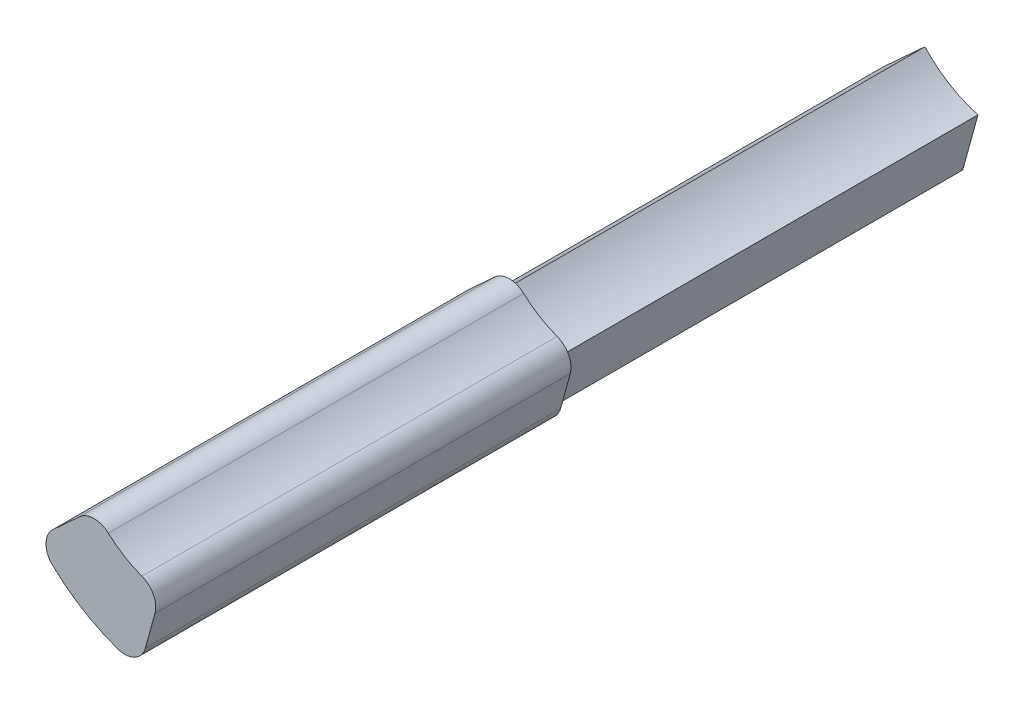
ISO-10303-21;
HEADER;
FILE_DESCRIPTION(('STEP AP214'),'2;1');
FILE_NAME('part.step','',(''),(''),'','','');
FILE_SCHEMA(('AUTOMOTIVE_DESIGN { 1 0 10303 214 1 1 1 1 }'));
ENDSEC;
DATA;
#1=APPLICATION_CONTEXT('core data for automotive mechanical design processes');
#2=APPLICATION_PROTOCOL_DEFINITION('international standard','automotive_design',2000,#1);
#3=PRODUCT_CONTEXT('',#1,'mechanical');
#4=PRODUCT('Part','Part','',(#3));
#5=PRODUCT_RELATED_PRODUCT_CATEGORY('part','',(#4));
#6=PRODUCT_DEFINITION_FORMATION('','',#4);
#7=PRODUCT_DEFINITION_CONTEXT('part definition',#1,'design');
#8=PRODUCT_DEFINITION('design','',#6,#7);
#9=PRODUCT_DEFINITION_SHAPE('','',#8);
#10=(LENGTH_UNIT() NAMED_UNIT(*) SI_UNIT(.MILLI.,.METRE.));
#11=(NAMED_UNIT(*) PLANE_ANGLE_UNIT() SI_UNIT($,.RADIAN.));
#12=(NAMED_UNIT(*) SI_UNIT($,.STERADIAN.) SOLID_ANGLE_UNIT());
#13=UNCERTAINTY_MEASURE_WITH_UNIT(LENGTH_MEASURE(1.E-05),#10,'distance_accuracy_value','');
#14=(GEOMETRIC_REPRESENTATION_CONTEXT(3) GLOBAL_UNCERTAINTY_ASSIGNED_CONTEXT((#13)) GLOBAL_UNIT_ASSIGNED_CONTEXT((#10,
#11,#12)) REPRESENTATION_CONTEXT('',''));
#15=CARTESIAN_POINT('',(0.,0.,0.));
#16=DIRECTION('',(0.,0.,1.));
#17=DIRECTION('',(1.,0.,0.));
#18=AXIS2_PLACEMENT_3D('',#15,#16,#17);
#19=CARTESIAN_POINT('',(-4.413136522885E-12,-4.13558076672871E-12,39.));
#20=DIRECTION('',(0.,0.,-1.));
#21=DIRECTION('',(-1.00000000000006,0.,0.));
#22=AXIS2_PLACEMENT_3D('',#19,#20,#21);
#23=CYLINDRICAL_SURFACE('',#22,8.);
#24=CARTESIAN_POINT('',(-3.740063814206E-12,-4.63518112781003E-12,19.4999999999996));
#25=DIRECTION('',(0.,0.,1.));
#26=DIRECTION('',(1.00000000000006,0.,0.));
#27=AXIS2_PLACEMENT_3D('',#24,#25,#26);
#28=CIRCLE('',#27,8.);
#29=CARTESIAN_POINT('',(-5.88910037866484,-5.41465573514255,19.4999999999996));
#30=VERTEX_POINT('',#29);
#31=CARTESIAN_POINT('',(-2.12490998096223,-7.71263622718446,19.5));
#32=VERTEX_POINT('',#31);
#33=EDGE_CURVE('E137',#30,#32,#28,.T.);
#34=ORIENTED_EDGE('',*,*,#33,.F.);
#35=DIRECTION('',(0.,0.,-1.));
#36=VECTOR('',#35,1.);
#37=CARTESIAN_POINT('',(-5.8891003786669,-5.41465573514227,39.));
#38=LINE('',#37,#36);
#39=CARTESIAN_POINT('',(-5.88910037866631,-5.41465573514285,-6.00214322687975E-13));
#40=VERTEX_POINT('',#39);
#41=EDGE_CURVE('E122',#30,#40,#38,.T.);
#42=ORIENTED_EDGE('',*,*,#41,.T.);
#43=CARTESIAN_POINT('',(0.,0.,0.));
#44=DIRECTION('',(0.,0.,1.));
#45=DIRECTION('',(1.00000000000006,0.,0.));
#46=AXIS2_PLACEMENT_3D('',#43,#44,#45);
#47=CIRCLE('',#46,8.);
#48=CARTESIAN_POINT('',(-2.12490998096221,-7.71263622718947,-9.64506252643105E-13));
#49=VERTEX_POINT('',#48);
#50=EDGE_CURVE('E141',#40,#49,#47,.T.);
#51=ORIENTED_EDGE('',*,*,#50,.T.);
#52=DIRECTION('',(0.,0.,-1.));
#53=VECTOR('',#52,1.);
#54=CARTESIAN_POINT('',(-2.1249099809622,-7.71263622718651,39.));
#55=LINE('',#54,#53);
#56=EDGE_CURVE('E138',#32,#49,#55,.T.);
#57=ORIENTED_EDGE('',*,*,#56,.F.);
#58=EDGE_LOOP('',(#34,#42,#51,#57));
#59=FACE_BOUND('',#58,.T.);
#60=ADVANCED_FACE('F35',(#59),#23,.T.);
#61=CARTESIAN_POINT('',(-1.40775286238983,-5.10962150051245,39.0000000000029));
#62=DIRECTION('',(-0.964079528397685,0.265613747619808,0.));
#63=DIRECTION('',(-0.26561374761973,-0.964079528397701,0.));
#64=AXIS2_PLACEMENT_3D('',#61,#62,#63);
#65=PLANE('',#64);
#66=DIRECTION('',(0.26561374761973,0.964079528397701,0.));
#67=VECTOR('',#66,1.);
#68=CARTESIAN_POINT('',(-1.40775286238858,-5.10962150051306,19.4999999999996));
#69=LINE('',#68,#67);
#70=CARTESIAN_POINT('',(-1.40775286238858,-5.10962150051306,19.4999999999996));
#71=VERTEX_POINT('',#70);
#72=EDGE_CURVE('E142',#32,#71,#69,.T.);
#73=ORIENTED_EDGE('',*,*,#72,.F.);
#74=ORIENTED_EDGE('',*,*,#56,.T.);
#75=DIRECTION('',(0.26561374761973,0.964079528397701,0.));
#76=VECTOR('',#75,1.);
#77=CARTESIAN_POINT('',(-1.40775286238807,-5.10962150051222,-5.96744875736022E-13));
#78=LINE('',#77,#76);
#79=CARTESIAN_POINT('',(-1.40775286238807,-5.10962150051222,-5.96744875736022E-13));
#80=VERTEX_POINT('',#79);
#81=EDGE_CURVE('E213',#49,#80,#78,.T.);
#82=ORIENTED_EDGE('',*,*,#81,.T.);
#83=DIRECTION('',(0.,0.,-1.));
#84=VECTOR('',#83,1.);
#85=CARTESIAN_POINT('',(-1.40775286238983,-5.10962150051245,39.0000000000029));
#86=LINE('',#85,#84);
#87=EDGE_CURVE('E151',#71,#80,#86,.T.);
#88=ORIENTED_EDGE('',*,*,#87,.F.);
#89=EDGE_LOOP('',(#73,#74,#82,#88));
#90=FACE_BOUND('',#89,.T.);
#91=ADVANCED_FACE('F226',(#90),#65,.F.);
#92=CARTESIAN_POINT('',(-4.413136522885E-12,-4.13558076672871E-12,39.));
#93=DIRECTION('',(0.,0.,-1.));
#94=DIRECTION('',(-1.00000000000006,0.,0.));
#95=AXIS2_PLACEMENT_3D('',#92,#93,#94);
#96=CYLINDRICAL_SURFACE('',#95,5.3);
#97=CARTESIAN_POINT('',(-3.740063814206E-12,-4.63518112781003E-12,19.4999999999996));
#98=DIRECTION('',(0.,0.,1.));
#99=DIRECTION('',(1.00000000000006,0.,0.));
#100=AXIS2_PLACEMENT_3D('',#97,#98,#99);
#101=CIRCLE('',#100,5.3);
#102=CARTESIAN_POINT('',(-3.90152900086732,-3.58720942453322,19.4999999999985));
#103=VERTEX_POINT('',#102);
#104=EDGE_CURVE('E146',#71,#103,#101,.F.);
#105=ORIENTED_EDGE('',*,*,#104,.F.);
#106=ORIENTED_EDGE('',*,*,#87,.T.);
#107=CARTESIAN_POINT('',(0.,0.,0.));
#108=DIRECTION('',(0.,0.,-1.));
#109=DIRECTION('',(1.00000000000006,0.,0.));
#110=AXIS2_PLACEMENT_3D('',#107,#108,#109);
#111=CIRCLE('',#110,5.3);
#112=CARTESIAN_POINT('',(-3.90152900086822,-3.58720942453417,-9.61036805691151E-13));
#113=VERTEX_POINT('',#112);
#114=EDGE_CURVE('E216',#80,#113,#111,.T.);
#115=ORIENTED_EDGE('',*,*,#114,.T.);
#116=DIRECTION('',(0.,0.,-1.));
#117=VECTOR('',#116,1.);
#118=CARTESIAN_POINT('',(-3.90152900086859,-3.58720942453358,39.));
#119=LINE('',#118,#117);
#120=EDGE_CURVE('E133',#103,#113,#119,.T.);
#121=ORIENTED_EDGE('',*,*,#120,.F.);
#122=EDGE_LOOP('',(#105,#106,#115,#121));
#123=FACE_BOUND('',#122,.T.);
#124=ADVANCED_FACE('F222',(#123),#96,.F.);
#125=CARTESIAN_POINT('',(-3.90152900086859,-3.58720942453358,39.));
#126=DIRECTION('',(0.676831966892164,-0.736137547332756,0.));
#127=DIRECTION('',(0.736137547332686,0.676831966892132,0.));
#128=AXIS2_PLACEMENT_3D('',#125,#126,#127);
#129=PLANE('',#128);
#130=DIRECTION('',(-0.736137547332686,-0.676831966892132,0.));
#131=VECTOR('',#130,1.);
#132=CARTESIAN_POINT('',(-3.90152900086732,-3.58720942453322,19.4999999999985));
#133=LINE('',#132,#131);
#134=EDGE_CURVE('E126',#103,#30,#133,.T.);
#135=ORIENTED_EDGE('',*,*,#134,.F.);
#136=ORIENTED_EDGE('',*,*,#120,.T.);
#137=DIRECTION('',(-0.736137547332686,-0.676831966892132,0.));
#138=VECTOR('',#137,1.);
#139=CARTESIAN_POINT('',(-3.90152900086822,-3.58720942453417,-9.61036805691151E-13));
#140=LINE('',#139,#138);
#141=EDGE_CURVE('E129',#113,#40,#140,.T.);
#142=ORIENTED_EDGE('',*,*,#141,.T.);
#143=ORIENTED_EDGE('',*,*,#41,.F.);
#144=EDGE_LOOP('',(#135,#136,#142,#143));
#145=FACE_BOUND('',#144,.T.);
#146=ADVANCED_FACE('F124',(#145),#129,.F.);
#147=CARTESIAN_POINT('',(0.,0.,0.));
#148=DIRECTION('',(0.,0.,1.));
#149=DIRECTION('',(1.00000000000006,0.,0.));
#150=AXIS2_PLACEMENT_3D('',#147,#148,#149);
#151=PLANE('',#150);
#152=ORIENTED_EDGE('',*,*,#50,.F.);
#153=ORIENTED_EDGE('',*,*,#141,.F.);
#154=ORIENTED_EDGE('',*,*,#114,.F.);
#155=ORIENTED_EDGE('',*,*,#81,.F.);
#156=EDGE_LOOP('',(#152,#153,#154,#155));
#157=FACE_BOUND('',#156,.T.);
#158=ADVANCED_FACE('F228',(#157),#151,.F.);
#159=CARTESIAN_POINT('',(-3.740063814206E-12,-4.63518112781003E-12,19.4999999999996));
#160=DIRECTION('',(0.,0.,1.));
#161=DIRECTION('',(1.00000000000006,0.,0.));
#162=AXIS2_PLACEMENT_3D('',#159,#160,#161);
#163=PLANE('',#162);
#164=CARTESIAN_POINT('',(-3.740063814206E-12,-4.63518112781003E-12,19.4999999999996));
#165=DIRECTION('',(0.,0.,1.));
#166=DIRECTION('',(1.00000000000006,0.,0.));
#167=AXIS2_PLACEMENT_3D('',#164,#165,#166);
#168=CIRCLE('',#167,8.5);
#169=CARTESIAN_POINT('',(-5.85971073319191,-6.15741748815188,19.5));
#170=VERTEX_POINT('',#169);
#171=CARTESIAN_POINT('',(-2.79900585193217,-8.02593086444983,19.5000000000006));
#172=VERTEX_POINT('',#171);
#173=EDGE_CURVE('E206',#170,#172,#168,.T.);
#174=ORIENTED_EDGE('',*,*,#173,.F.);
#175=CARTESIAN_POINT('',(-5.17033299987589,-5.43301543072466,19.4999999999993));
#176=DIRECTION('',(0.,0.,1.));
#177=DIRECTION('',(1.00000000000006,0.,0.));
#178=AXIS2_PLACEMENT_3D('',#175,#176,#177);
#179=CIRCLE('',#178,1.);
#180=CARTESIAN_POINT('',(-5.84716496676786,-4.69687788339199,19.4999999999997));
#181=VERTEX_POINT('',#180);
#182=EDGE_CURVE('E175',#170,#181,#179,.F.);
#183=ORIENTED_EDGE('',*,*,#182,.T.);
#184=DIRECTION('',(-0.736137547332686,-0.676831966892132,0.));
#185=VECTOR('',#184,1.);
#186=CARTESIAN_POINT('',(-3.85265367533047,-2.86305076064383,19.4999999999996));
#187=LINE('',#186,#185);
#188=CARTESIAN_POINT('',(-4.59211913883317,-3.54294253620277,19.5000000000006));
#189=VERTEX_POINT('',#188);
#190=EDGE_CURVE('E198',#189,#181,#187,.T.);
#191=ORIENTED_EDGE('',*,*,#190,.F.);
#192=CARTESIAN_POINT('',(-3.91528717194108,-4.27908008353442,19.4999999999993));
#193=DIRECTION('',(0.,0.,1.));
#194=DIRECTION('',(1.00000000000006,0.,0.));
#195=AXIS2_PLACEMENT_3D('',#192,#193,#194);
#196=CIRCLE('',#195,1.);
#197=CARTESIAN_POINT('',(-3.24023765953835,-3.54130765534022,19.4999999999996));
#198=VERTEX_POINT('',#197);
#199=EDGE_CURVE('E173',#189,#198,#196,.F.);
#200=ORIENTED_EDGE('',*,*,#199,.T.);
#201=CARTESIAN_POINT('',(-3.740063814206E-12,-4.63518112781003E-12,19.4999999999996));
#202=DIRECTION('',(0.,0.,-1.));
#203=DIRECTION('',(1.00000000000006,0.,0.));
#204=AXIS2_PLACEMENT_3D('',#201,#202,#203);
#205=CIRCLE('',#204,4.8);
#206=CARTESIAN_POINT('',(-1.66912915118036,-4.50044529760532,19.4999999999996));
#207=VERTEX_POINT('',#206);
#208=EDGE_CURVE('E194',#207,#198,#205,.T.);
#209=ORIENTED_EDGE('',*,*,#208,.F.);
#210=CARTESIAN_POINT('',(-2.01686439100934,-5.4380380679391,19.5000000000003));
#211=DIRECTION('',(0.,0.,1.));
#212=DIRECTION('',(1.00000000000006,0.,0.));
#213=AXIS2_PLACEMENT_3D('',#210,#211,#212);
#214=CIRCLE('',#213,1.);
#215=CARTESIAN_POINT('',(-1.05278486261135,-5.70365181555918,19.4999999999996));
#216=VERTEX_POINT('',#215);
#217=EDGE_CURVE('E49',#207,#216,#214,.F.);
#218=ORIENTED_EDGE('',*,*,#217,.T.);
#219=DIRECTION('',(0.26561374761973,0.964079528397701,0.));
#220=VECTOR('',#219,1.);
#221=CARTESIAN_POINT('',(-1.77176762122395,-8.31329293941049,19.4999999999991));
#222=LINE('',#221,#220);
#223=CARTESIAN_POINT('',(-1.50563151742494,-7.34731745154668,19.5000000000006));
#224=VERTEX_POINT('',#223);
#225=EDGE_CURVE('E186',#224,#216,#222,.T.);
#226=ORIENTED_EDGE('',*,*,#225,.F.);
#227=CARTESIAN_POINT('',(-2.46971104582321,-7.08170370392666,19.5));
#228=DIRECTION('',(0.,0.,1.));
#229=DIRECTION('',(1.00000000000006,0.,0.));
#230=AXIS2_PLACEMENT_3D('',#227,#228,#229);
#231=CIRCLE('',#230,1.);
#232=EDGE_CURVE('E171',#224,#172,#231,.F.);
#233=ORIENTED_EDGE('',*,*,#232,.T.);
#234=EDGE_LOOP('',(#174,#183,#191,#200,#209,#218,#226,#233));
#235=FACE_BOUND('',#234,.T.);
#236=ORIENTED_EDGE('',*,*,#134,.T.);
#237=ORIENTED_EDGE('',*,*,#33,.T.);
#238=ORIENTED_EDGE('',*,*,#72,.T.);
#239=ORIENTED_EDGE('',*,*,#104,.T.);
#240=EDGE_LOOP('',(#236,#237,#238,#239));
#241=FACE_BOUND('',#240,.T.);
#242=ADVANCED_FACE('F145',(#235,#241),#163,.F.);
#243=CARTESIAN_POINT('',(-3.740063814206E-12,-4.63518112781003E-12,19.4999999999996));
#244=DIRECTION('',(0.,0.,1.));
#245=DIRECTION('',(1.00000000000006,0.,0.));
#246=AXIS2_PLACEMENT_3D('',#243,#244,#245);
#247=CYLINDRICAL_SURFACE('',#246,4.8);
#248=ORIENTED_EDGE('',*,*,#208,.T.);
#249=DIRECTION('',(0.,0.,1.));
#250=VECTOR('',#249,1.);
#251=CARTESIAN_POINT('',(-3.24023765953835,-3.54130765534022,19.4999999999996));
#252=LINE('',#251,#250);
#253=CARTESIAN_POINT('',(-3.24023765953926,-3.54130765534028,39.));
#254=VERTEX_POINT('',#253);
#255=EDGE_CURVE('E179',#198,#254,#252,.T.);
#256=ORIENTED_EDGE('',*,*,#255,.T.);
#257=CARTESIAN_POINT('',(-4.413136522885E-12,-4.13558076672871E-12,39.));
#258=DIRECTION('',(0.,0.,-1.));
#259=DIRECTION('',(1.00000000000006,0.,0.));
#260=AXIS2_PLACEMENT_3D('',#257,#258,#259);
#261=CIRCLE('',#260,4.8);
#262=CARTESIAN_POINT('',(-1.66912915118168,-4.50044529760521,39.0000000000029));
#263=VERTEX_POINT('',#262);
#264=EDGE_CURVE('E278',#263,#254,#261,.T.);
#265=ORIENTED_EDGE('',*,*,#264,.F.);
#266=DIRECTION('',(0.,0.,1.));
#267=VECTOR('',#266,1.);
#268=CARTESIAN_POINT('',(-1.66912915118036,-4.50044529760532,19.4999999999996));
#269=LINE('',#268,#267);
#270=EDGE_CURVE('E177',#263,#207,#269,.F.);
#271=ORIENTED_EDGE('',*,*,#270,.T.);
#272=EDGE_LOOP('',(#248,#256,#265,#271));
#273=FACE_BOUND('',#272,.T.);
#274=ADVANCED_FACE('F235',(#273),#247,.F.);
#275=CARTESIAN_POINT('',(-1.77176762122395,-8.31329293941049,19.4999999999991));
#276=DIRECTION('',(0.964079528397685,-0.265613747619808,0.));
#277=DIRECTION('',(0.26561374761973,0.964079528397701,0.));
#278=AXIS2_PLACEMENT_3D('',#275,#276,#277);
#279=PLANE('',#278);
#280=DIRECTION('',(0.26561374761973,0.964079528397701,0.));
#281=VECTOR('',#280,1.);
#282=CARTESIAN_POINT('',(-1.77176762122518,-8.31329293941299,39.));
#283=LINE('',#282,#281);
#284=CARTESIAN_POINT('',(-1.50563151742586,-7.34731745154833,39.));
#285=VERTEX_POINT('',#284);
#286=CARTESIAN_POINT('',(-1.0527848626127,-5.70365181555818,39.0000000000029));
#287=VERTEX_POINT('',#286);
#288=EDGE_CURVE('E185',#285,#287,#283,.T.);
#289=ORIENTED_EDGE('',*,*,#288,.F.);
#290=DIRECTION('',(0.,0.,1.));
#291=VECTOR('',#290,1.);
#292=CARTESIAN_POINT('',(-1.50563151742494,-7.34731745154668,19.5000000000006));
#293=LINE('',#292,#291);
#294=EDGE_CURVE('E11',#285,#224,#293,.F.);
#295=ORIENTED_EDGE('',*,*,#294,.T.);
#296=ORIENTED_EDGE('',*,*,#225,.T.);
#297=DIRECTION('',(0.,0.,1.));
#298=VECTOR('',#297,1.);
#299=CARTESIAN_POINT('',(-1.05278486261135,-5.70365181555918,19.4999999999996));
#300=LINE('',#299,#298);
#301=EDGE_CURVE('E42',#216,#287,#300,.T.);
#302=ORIENTED_EDGE('',*,*,#301,.T.);
#303=EDGE_LOOP('',(#289,#295,#296,#302));
#304=FACE_BOUND('',#303,.T.);
#305=ADVANCED_FACE('F184',(#304),#279,.T.);
#306=CARTESIAN_POINT('',(-3.740063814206E-12,-4.63518112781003E-12,19.4999999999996));
#307=DIRECTION('',(0.,0.,1.));
#308=DIRECTION('',(1.00000000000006,0.,0.));
#309=AXIS2_PLACEMENT_3D('',#306,#307,#308);
#310=CYLINDRICAL_SURFACE('',#309,8.5);
#311=CARTESIAN_POINT('',(-4.413136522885E-12,-4.13558076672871E-12,39.));
#312=DIRECTION('',(0.,0.,1.));
#313=DIRECTION('',(1.00000000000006,0.,0.));
#314=AXIS2_PLACEMENT_3D('',#311,#312,#313);
#315=CIRCLE('',#314,8.5);
#316=CARTESIAN_POINT('',(-5.85971073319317,-6.15741748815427,39.));
#317=VERTEX_POINT('',#316);
#318=CARTESIAN_POINT('',(-2.79900585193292,-8.02593086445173,38.9999999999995));
#319=VERTEX_POINT('',#318);
#320=EDGE_CURVE('E195',#317,#319,#315,.T.);
#321=ORIENTED_EDGE('',*,*,#320,.F.);
#322=DIRECTION('',(0.,0.,1.));
#323=VECTOR('',#322,1.);
#324=CARTESIAN_POINT('',(-5.85971073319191,-6.15741748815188,19.5));
#325=LINE('',#324,#323);
#326=EDGE_CURVE('E168',#317,#170,#325,.F.);
#327=ORIENTED_EDGE('',*,*,#326,.T.);
#328=ORIENTED_EDGE('',*,*,#173,.T.);
#329=DIRECTION('',(0.,0.,1.));
#330=VECTOR('',#329,1.);
#331=CARTESIAN_POINT('',(-2.79900585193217,-8.02593086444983,19.5000000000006));
#332=LINE('',#331,#330);
#333=EDGE_CURVE('E165',#172,#319,#332,.T.);
#334=ORIENTED_EDGE('',*,*,#333,.T.);
#335=EDGE_LOOP('',(#321,#327,#328,#334));
#336=FACE_BOUND('',#335,.T.);
#337=ADVANCED_FACE('F258',(#336),#310,.T.);
#338=CARTESIAN_POINT('',(-3.85265367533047,-2.86305076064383,19.4999999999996));
#339=DIRECTION('',(-0.676831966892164,0.736137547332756,0.));
#340=DIRECTION('',(-0.736137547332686,-0.676831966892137,0.));
#341=AXIS2_PLACEMENT_3D('',#338,#339,#340);
#342=PLANE('',#341);
#343=ORIENTED_EDGE('',*,*,#190,.T.);
#344=DIRECTION('',(0.,0.,1.));
#345=VECTOR('',#344,1.);
#346=CARTESIAN_POINT('',(-5.84716496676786,-4.69687788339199,19.4999999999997));
#347=LINE('',#346,#345);
#348=CARTESIAN_POINT('',(-5.84716496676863,-4.69687788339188,39.));
#349=VERTEX_POINT('',#348);
#350=EDGE_CURVE('E149',#181,#349,#347,.T.);
#351=ORIENTED_EDGE('',*,*,#350,.T.);
#352=DIRECTION('',(-0.736137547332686,-0.676831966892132,0.));
#353=VECTOR('',#352,1.);
#354=CARTESIAN_POINT('',(-3.85265367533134,-2.86305076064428,39.));
#355=LINE('',#354,#353);
#356=CARTESIAN_POINT('',(-4.59211913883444,-3.54294253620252,38.9999999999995));
#357=VERTEX_POINT('',#356);
#358=EDGE_CURVE('E200',#357,#349,#355,.T.);
#359=ORIENTED_EDGE('',*,*,#358,.F.);
#360=DIRECTION('',(0.,0.,1.));
#361=VECTOR('',#360,1.);
#362=CARTESIAN_POINT('',(-4.59211913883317,-3.54294253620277,19.5000000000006));
#363=LINE('',#362,#361);
#364=EDGE_CURVE('E147',#357,#189,#363,.F.);
#365=ORIENTED_EDGE('',*,*,#364,.T.);
#366=EDGE_LOOP('',(#343,#351,#359,#365));
#367=FACE_BOUND('',#366,.T.);
#368=ADVANCED_FACE('F250',(#367),#342,.T.);
#369=CARTESIAN_POINT('',(-4.413136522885E-12,-4.13558076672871E-12,39.));
#370=DIRECTION('',(0.,0.,1.));
#371=DIRECTION('',(1.00000000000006,0.,0.));
#372=AXIS2_PLACEMENT_3D('',#369,#370,#371);
#373=PLANE('',#372);
#374=ORIENTED_EDGE('',*,*,#358,.T.);
#375=CARTESIAN_POINT('',(-5.17033299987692,-5.43301543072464,39.));
#376=DIRECTION('',(0.,0.,1.));
#377=DIRECTION('',(1.00000000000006,0.,0.));
#378=AXIS2_PLACEMENT_3D('',#375,#376,#377);
#379=CIRCLE('',#378,1.);
#380=EDGE_CURVE('E163',#349,#317,#379,.T.);
#381=ORIENTED_EDGE('',*,*,#380,.T.);
#382=ORIENTED_EDGE('',*,*,#320,.T.);
#383=CARTESIAN_POINT('',(-2.46971104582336,-7.08170370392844,39.));
#384=DIRECTION('',(0.,0.,1.));
#385=DIRECTION('',(1.00000000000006,0.,0.));
#386=AXIS2_PLACEMENT_3D('',#383,#384,#385);
#387=CIRCLE('',#386,1.);
#388=EDGE_CURVE('E159',#319,#285,#387,.T.);
#389=ORIENTED_EDGE('',*,*,#388,.T.);
#390=ORIENTED_EDGE('',*,*,#288,.T.);
#391=CARTESIAN_POINT('',(-2.01686439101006,-5.4380380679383,39.));
#392=DIRECTION('',(0.,0.,1.));
#393=DIRECTION('',(1.00000000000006,0.,0.));
#394=AXIS2_PLACEMENT_3D('',#391,#392,#393);
#395=CIRCLE('',#394,1.);
#396=EDGE_CURVE('E157',#287,#263,#395,.T.);
#397=ORIENTED_EDGE('',*,*,#396,.T.);
#398=ORIENTED_EDGE('',*,*,#264,.T.);
#399=CARTESIAN_POINT('',(-3.91528717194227,-4.27908008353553,38.9999999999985));
#400=DIRECTION('',(0.,0.,1.));
#401=DIRECTION('',(1.00000000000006,0.,0.));
#402=AXIS2_PLACEMENT_3D('',#399,#400,#401);
#403=CIRCLE('',#402,1.);
#404=EDGE_CURVE('E161',#254,#357,#403,.T.);
#405=ORIENTED_EDGE('',*,*,#404,.T.);
#406=EDGE_LOOP('',(#374,#381,#382,#389,#390,#397,#398,#405));
#407=FACE_BOUND('',#406,.T.);
#408=ADVANCED_FACE('F190',(#407),#373,.T.);
#409=CARTESIAN_POINT('',(-5.17033299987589,-5.43301543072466,19.4999999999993));
#410=DIRECTION('',(0.,0.,1.));
#411=DIRECTION('',(1.00000000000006,0.,0.));
#412=AXIS2_PLACEMENT_3D('',#409,#410,#411);
#413=CYLINDRICAL_SURFACE('',#412,1.);
#414=ORIENTED_EDGE('',*,*,#182,.F.);
#415=ORIENTED_EDGE('',*,*,#326,.F.);
#416=ORIENTED_EDGE('',*,*,#380,.F.);
#417=ORIENTED_EDGE('',*,*,#350,.F.);
#418=EDGE_LOOP('',(#414,#415,#416,#417));
#419=FACE_BOUND('',#418,.T.);
#420=ADVANCED_FACE('F249',(#419),#413,.T.);
#421=CARTESIAN_POINT('',(-3.91528717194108,-4.27908008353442,19.4999999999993));
#422=DIRECTION('',(0.,0.,1.));
#423=DIRECTION('',(1.00000000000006,0.,0.));
#424=AXIS2_PLACEMENT_3D('',#421,#422,#423);
#425=CYLINDRICAL_SURFACE('',#424,1.);
#426=ORIENTED_EDGE('',*,*,#199,.F.);
#427=ORIENTED_EDGE('',*,*,#364,.F.);
#428=ORIENTED_EDGE('',*,*,#404,.F.);
#429=ORIENTED_EDGE('',*,*,#255,.F.);
#430=EDGE_LOOP('',(#426,#427,#428,#429));
#431=FACE_BOUND('',#430,.T.);
#432=ADVANCED_FACE('F255',(#431),#425,.T.);
#433=CARTESIAN_POINT('',(-2.46971104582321,-7.08170370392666,19.5));
#434=DIRECTION('',(0.,0.,1.));
#435=DIRECTION('',(1.00000000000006,0.,0.));
#436=AXIS2_PLACEMENT_3D('',#433,#434,#435);
#437=CYLINDRICAL_SURFACE('',#436,1.);
#438=ORIENTED_EDGE('',*,*,#232,.F.);
#439=ORIENTED_EDGE('',*,*,#294,.F.);
#440=ORIENTED_EDGE('',*,*,#388,.F.);
#441=ORIENTED_EDGE('',*,*,#333,.F.);
#442=EDGE_LOOP('',(#438,#439,#440,#441));
#443=FACE_BOUND('',#442,.T.);
#444=ADVANCED_FACE('F289',(#443),#437,.T.);
#445=CARTESIAN_POINT('',(-2.01686439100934,-5.4380380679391,19.5000000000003));
#446=DIRECTION('',(0.,0.,1.));
#447=DIRECTION('',(1.00000000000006,0.,0.));
#448=AXIS2_PLACEMENT_3D('',#445,#446,#447);
#449=CYLINDRICAL_SURFACE('',#448,1.);
#450=ORIENTED_EDGE('',*,*,#217,.F.);
#451=ORIENTED_EDGE('',*,*,#270,.F.);
#452=ORIENTED_EDGE('',*,*,#396,.F.);
#453=ORIENTED_EDGE('',*,*,#301,.F.);
#454=EDGE_LOOP('',(#450,#451,#452,#453));
#455=FACE_BOUND('',#454,.T.);
#456=ADVANCED_FACE('F291',(#455),#449,.T.);
#457=CLOSED_SHELL('',(#60,#91,#124,#146,#158,#242,#274,#305,#337,#368,#408,#420,#432,#444,#456));
#458=MANIFOLD_SOLID_BREP('B2',#457);
#459=ADVANCED_BREP_SHAPE_REPRESENTATION('',(#18,#458),#14);
#460=SHAPE_DEFINITION_REPRESENTATION(#9,#459);
ENDSEC;
END-ISO-10303-21;
